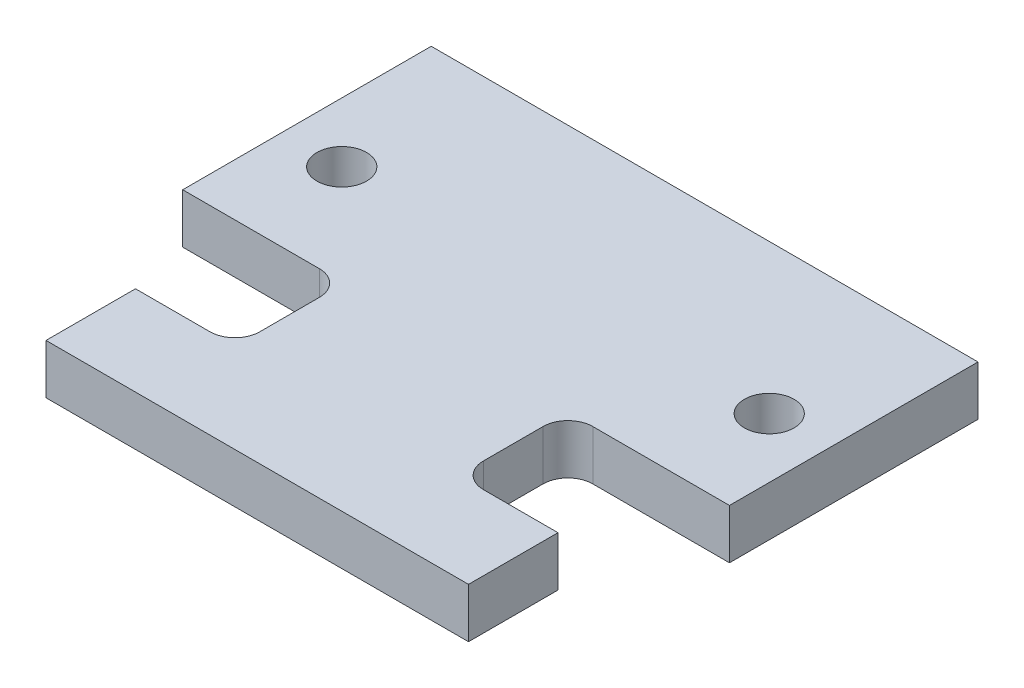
ISO-10303-21;
HEADER;
FILE_DESCRIPTION(('STEP AP214'),'2;1');
FILE_NAME('part.step','',(''),(''),'','','');
FILE_SCHEMA(('AUTOMOTIVE_DESIGN { 1 0 10303 214 1 1 1 1 }'));
ENDSEC;
DATA;
#1=APPLICATION_CONTEXT('core data for automotive mechanical design processes');
#2=APPLICATION_PROTOCOL_DEFINITION('international standard','automotive_design',2000,#1);
#3=PRODUCT_CONTEXT('',#1,'mechanical');
#4=PRODUCT('Part','Part','',(#3));
#5=PRODUCT_RELATED_PRODUCT_CATEGORY('part','',(#4));
#6=PRODUCT_DEFINITION_FORMATION('','',#4);
#7=PRODUCT_DEFINITION_CONTEXT('part definition',#1,'design');
#8=PRODUCT_DEFINITION('design','',#6,#7);
#9=PRODUCT_DEFINITION_SHAPE('','',#8);
#10=(LENGTH_UNIT() NAMED_UNIT(*) SI_UNIT(.MILLI.,.METRE.));
#11=(NAMED_UNIT(*) PLANE_ANGLE_UNIT() SI_UNIT($,.RADIAN.));
#12=(NAMED_UNIT(*) SI_UNIT($,.STERADIAN.) SOLID_ANGLE_UNIT());
#13=UNCERTAINTY_MEASURE_WITH_UNIT(LENGTH_MEASURE(1.E-05),#10,'distance_accuracy_value','');
#14=(GEOMETRIC_REPRESENTATION_CONTEXT(3) GLOBAL_UNCERTAINTY_ASSIGNED_CONTEXT((#13)) GLOBAL_UNIT_ASSIGNED_CONTEXT((#10,
#11,#12)) REPRESENTATION_CONTEXT('',''));
#15=CARTESIAN_POINT('',(0.,0.,0.));
#16=DIRECTION('',(0.,0.,1.));
#17=DIRECTION('',(1.,0.,0.));
#18=AXIS2_PLACEMENT_3D('',#15,#16,#17);
#19=CARTESIAN_POINT('',(-55.,10.,0.));
#20=DIRECTION('',(1.,0.,0.));
#21=DIRECTION('',(0.,0.,-1.));
#22=AXIS2_PLACEMENT_3D('',#19,#20,#21);
#23=PLANE('',#22);
#24=DIRECTION('',(0.,0.,1.));
#25=VECTOR('',#24,1.);
#26=CARTESIAN_POINT('',(-55.,0.,0.));
#27=LINE('',#26,#25);
#28=CARTESIAN_POINT('',(-55.,0.,0.));
#29=VERTEX_POINT('',#28);
#30=CARTESIAN_POINT('',(-55.,0.,50.));
#31=VERTEX_POINT('',#30);
#32=EDGE_CURVE('E177',#29,#31,#27,.T.);
#33=ORIENTED_EDGE('',*,*,#32,.T.);
#34=DIRECTION('',(0.,-1.,0.));
#35=VECTOR('',#34,1.);
#36=CARTESIAN_POINT('',(-55.,10.,50.));
#37=LINE('',#36,#35);
#38=CARTESIAN_POINT('',(-55.,10.,50.));
#39=VERTEX_POINT('',#38);
#40=EDGE_CURVE('E160',#39,#31,#37,.T.);
#41=ORIENTED_EDGE('',*,*,#40,.F.);
#42=DIRECTION('',(0.,0.,1.));
#43=VECTOR('',#42,1.);
#44=CARTESIAN_POINT('',(-55.,10.,0.));
#45=LINE('',#44,#43);
#46=CARTESIAN_POINT('',(-55.,10.,0.));
#47=VERTEX_POINT('',#46);
#48=EDGE_CURVE('E165',#47,#39,#45,.T.);
#49=ORIENTED_EDGE('',*,*,#48,.F.);
#50=DIRECTION('',(0.,-1.,0.));
#51=VECTOR('',#50,1.);
#52=CARTESIAN_POINT('',(-55.,10.,0.));
#53=LINE('',#52,#51);
#54=EDGE_CURVE('E262',#47,#29,#53,.T.);
#55=ORIENTED_EDGE('',*,*,#54,.T.);
#56=EDGE_LOOP('',(#33,#41,#49,#55));
#57=FACE_BOUND('',#56,.T.);
#58=ADVANCED_FACE('F47',(#57),#23,.F.);
#59=CARTESIAN_POINT('',(-55.,10.,50.));
#60=DIRECTION('',(0.,0.,-1.));
#61=DIRECTION('',(-1.,0.,0.));
#62=AXIS2_PLACEMENT_3D('',#59,#60,#61);
#63=PLANE('',#62);
#64=DIRECTION('',(1.,0.,0.));
#65=VECTOR('',#64,1.);
#66=CARTESIAN_POINT('',(-55.,0.,50.));
#67=LINE('',#66,#65);
#68=CARTESIAN_POINT('',(-27.5,0.,50.));
#69=VERTEX_POINT('',#68);
#70=EDGE_CURVE('E239',#31,#69,#67,.T.);
#71=ORIENTED_EDGE('',*,*,#70,.T.);
#72=DIRECTION('',(0.,-1.,0.));
#73=VECTOR('',#72,1.);
#74=CARTESIAN_POINT('',(-27.5,10.,50.));
#75=LINE('',#74,#73);
#76=CARTESIAN_POINT('',(-27.5,10.,50.));
#77=VERTEX_POINT('',#76);
#78=EDGE_CURVE('E62',#69,#77,#75,.F.);
#79=ORIENTED_EDGE('',*,*,#78,.T.);
#80=DIRECTION('',(1.,0.,0.));
#81=VECTOR('',#80,1.);
#82=CARTESIAN_POINT('',(-55.,10.,50.));
#83=LINE('',#82,#81);
#84=EDGE_CURVE('E156',#39,#77,#83,.T.);
#85=ORIENTED_EDGE('',*,*,#84,.F.);
#86=ORIENTED_EDGE('',*,*,#40,.T.);
#87=EDGE_LOOP('',(#71,#79,#85,#86));
#88=FACE_BOUND('',#87,.T.);
#89=ADVANCED_FACE('F158',(#88),#63,.F.);
#90=CARTESIAN_POINT('',(-22.5,10.,50.));
#91=DIRECTION('',(1.,0.,0.));
#92=DIRECTION('',(0.,0.,-1.));
#93=AXIS2_PLACEMENT_3D('',#90,#91,#92);
#94=PLANE('',#93);
#95=DIRECTION('',(0.,0.,1.));
#96=VECTOR('',#95,1.);
#97=CARTESIAN_POINT('',(-22.5,0.,50.));
#98=LINE('',#97,#96);
#99=CARTESIAN_POINT('',(-22.5,0.,55.));
#100=VERTEX_POINT('',#99);
#101=CARTESIAN_POINT('',(-22.5,0.,67.));
#102=VERTEX_POINT('',#101);
#103=EDGE_CURVE('E233',#100,#102,#98,.T.);
#104=ORIENTED_EDGE('',*,*,#103,.T.);
#105=DIRECTION('',(0.,-1.,0.));
#106=VECTOR('',#105,1.);
#107=CARTESIAN_POINT('',(-22.5,10.,67.));
#108=LINE('',#107,#106);
#109=CARTESIAN_POINT('',(-22.5,10.,67.));
#110=VERTEX_POINT('',#109);
#111=EDGE_CURVE('E201',#102,#110,#108,.F.);
#112=ORIENTED_EDGE('',*,*,#111,.T.);
#113=DIRECTION('',(0.,0.,1.));
#114=VECTOR('',#113,1.);
#115=CARTESIAN_POINT('',(-22.5,10.,50.));
#116=LINE('',#115,#114);
#117=CARTESIAN_POINT('',(-22.5,10.,55.));
#118=VERTEX_POINT('',#117);
#119=EDGE_CURVE('E164',#118,#110,#116,.T.);
#120=ORIENTED_EDGE('',*,*,#119,.F.);
#121=DIRECTION('',(0.,-1.,0.));
#122=VECTOR('',#121,1.);
#123=CARTESIAN_POINT('',(-22.5,0.,55.));
#124=LINE('',#123,#122);
#125=EDGE_CURVE('E198',#118,#100,#124,.T.);
#126=ORIENTED_EDGE('',*,*,#125,.T.);
#127=EDGE_LOOP('',(#104,#112,#120,#126));
#128=FACE_BOUND('',#127,.T.);
#129=ADVANCED_FACE('F237',(#128),#94,.F.);
#130=CARTESIAN_POINT('',(-42.5,10.,72.));
#131=DIRECTION('',(0.,0.,1.));
#132=DIRECTION('',(1.,0.,0.));
#133=AXIS2_PLACEMENT_3D('',#130,#131,#132);
#134=PLANE('',#133);
#135=DIRECTION('',(-1.,0.,0.));
#136=VECTOR('',#135,1.);
#137=CARTESIAN_POINT('',(-42.5,10.,72.));
#138=LINE('',#137,#136);
#139=CARTESIAN_POINT('',(-27.5,10.,72.));
#140=VERTEX_POINT('',#139);
#141=CARTESIAN_POINT('',(-42.5,10.,72.));
#142=VERTEX_POINT('',#141);
#143=EDGE_CURVE('E218',#140,#142,#138,.T.);
#144=ORIENTED_EDGE('',*,*,#143,.F.);
#145=DIRECTION('',(0.,-1.,0.));
#146=VECTOR('',#145,1.);
#147=CARTESIAN_POINT('',(-27.5,0.,72.));
#148=LINE('',#147,#146);
#149=CARTESIAN_POINT('',(-27.5,0.,72.));
#150=VERTEX_POINT('',#149);
#151=EDGE_CURVE('E195',#140,#150,#148,.T.);
#152=ORIENTED_EDGE('',*,*,#151,.T.);
#153=DIRECTION('',(-1.,0.,0.));
#154=VECTOR('',#153,1.);
#155=CARTESIAN_POINT('',(-42.5,0.,72.));
#156=LINE('',#155,#154);
#157=CARTESIAN_POINT('',(-42.5,0.,72.));
#158=VERTEX_POINT('',#157);
#159=EDGE_CURVE('E235',#150,#158,#156,.T.);
#160=ORIENTED_EDGE('',*,*,#159,.T.);
#161=DIRECTION('',(0.,-1.,0.));
#162=VECTOR('',#161,1.);
#163=CARTESIAN_POINT('',(-42.5,10.,72.));
#164=LINE('',#163,#162);
#165=EDGE_CURVE('E179',#142,#158,#164,.T.);
#166=ORIENTED_EDGE('',*,*,#165,.F.);
#167=EDGE_LOOP('',(#144,#152,#160,#166));
#168=FACE_BOUND('',#167,.T.);
#169=ADVANCED_FACE('F225',(#168),#134,.F.);
#170=CARTESIAN_POINT('',(-42.5,10.,72.));
#171=DIRECTION('',(1.,0.,0.));
#172=DIRECTION('',(0.,0.,-1.));
#173=AXIS2_PLACEMENT_3D('',#170,#171,#172);
#174=PLANE('',#173);
#175=DIRECTION('',(0.,0.,1.));
#176=VECTOR('',#175,1.);
#177=CARTESIAN_POINT('',(-42.5,0.,72.));
#178=LINE('',#177,#176);
#179=CARTESIAN_POINT('',(-42.5,0.,90.));
#180=VERTEX_POINT('',#179);
#181=EDGE_CURVE('E241',#158,#180,#178,.T.);
#182=ORIENTED_EDGE('',*,*,#181,.T.);
#183=DIRECTION('',(0.,-1.,0.));
#184=VECTOR('',#183,1.);
#185=CARTESIAN_POINT('',(-42.5,10.,90.));
#186=LINE('',#185,#184);
#187=CARTESIAN_POINT('',(-42.5,10.,90.));
#188=VERTEX_POINT('',#187);
#189=EDGE_CURVE('E185',#188,#180,#186,.T.);
#190=ORIENTED_EDGE('',*,*,#189,.F.);
#191=DIRECTION('',(0.,0.,1.));
#192=VECTOR('',#191,1.);
#193=CARTESIAN_POINT('',(-42.5,10.,72.));
#194=LINE('',#193,#192);
#195=EDGE_CURVE('E228',#142,#188,#194,.T.);
#196=ORIENTED_EDGE('',*,*,#195,.F.);
#197=ORIENTED_EDGE('',*,*,#165,.T.);
#198=EDGE_LOOP('',(#182,#190,#196,#197));
#199=FACE_BOUND('',#198,.T.);
#200=ADVANCED_FACE('F323',(#199),#174,.F.);
#201=CARTESIAN_POINT('',(-42.5,10.,90.));
#202=DIRECTION('',(0.,0.,-1.));
#203=DIRECTION('',(-1.,0.,0.));
#204=AXIS2_PLACEMENT_3D('',#201,#202,#203);
#205=PLANE('',#204);
#206=DIRECTION('',(1.,0.,0.));
#207=VECTOR('',#206,1.);
#208=CARTESIAN_POINT('',(-42.5,0.,90.));
#209=LINE('',#208,#207);
#210=CARTESIAN_POINT('',(42.5,0.,90.));
#211=VERTEX_POINT('',#210);
#212=EDGE_CURVE('E247',#180,#211,#209,.T.);
#213=ORIENTED_EDGE('',*,*,#212,.T.);
#214=DIRECTION('',(0.,-1.,0.));
#215=VECTOR('',#214,1.);
#216=CARTESIAN_POINT('',(42.5,10.,90.));
#217=LINE('',#216,#215);
#218=CARTESIAN_POINT('',(42.5,10.,90.));
#219=VERTEX_POINT('',#218);
#220=EDGE_CURVE('E273',#219,#211,#217,.T.);
#221=ORIENTED_EDGE('',*,*,#220,.F.);
#222=DIRECTION('',(1.,0.,0.));
#223=VECTOR('',#222,1.);
#224=CARTESIAN_POINT('',(-42.5,10.,90.));
#225=LINE('',#224,#223);
#226=EDGE_CURVE('E282',#188,#219,#225,.T.);
#227=ORIENTED_EDGE('',*,*,#226,.F.);
#228=ORIENTED_EDGE('',*,*,#189,.T.);
#229=EDGE_LOOP('',(#213,#221,#227,#228));
#230=FACE_BOUND('',#229,.T.);
#231=ADVANCED_FACE('F280',(#230),#205,.F.);
#232=CARTESIAN_POINT('',(42.5,10.,72.));
#233=DIRECTION('',(-1.,0.,0.));
#234=DIRECTION('',(0.,0.,1.));
#235=AXIS2_PLACEMENT_3D('',#232,#233,#234);
#236=PLANE('',#235);
#237=DIRECTION('',(0.,0.,-1.));
#238=VECTOR('',#237,1.);
#239=CARTESIAN_POINT('',(42.5,0.,72.));
#240=LINE('',#239,#238);
#241=CARTESIAN_POINT('',(42.5,0.,72.));
#242=VERTEX_POINT('',#241);
#243=EDGE_CURVE('E249',#211,#242,#240,.T.);
#244=ORIENTED_EDGE('',*,*,#243,.T.);
#245=DIRECTION('',(0.,-1.,0.));
#246=VECTOR('',#245,1.);
#247=CARTESIAN_POINT('',(42.5,10.,72.));
#248=LINE('',#247,#246);
#249=CARTESIAN_POINT('',(42.5,10.,72.));
#250=VERTEX_POINT('',#249);
#251=EDGE_CURVE('E270',#250,#242,#248,.T.);
#252=ORIENTED_EDGE('',*,*,#251,.F.);
#253=DIRECTION('',(0.,0.,-1.));
#254=VECTOR('',#253,1.);
#255=CARTESIAN_POINT('',(42.5,10.,72.));
#256=LINE('',#255,#254);
#257=EDGE_CURVE('E298',#219,#250,#256,.T.);
#258=ORIENTED_EDGE('',*,*,#257,.F.);
#259=ORIENTED_EDGE('',*,*,#220,.T.);
#260=EDGE_LOOP('',(#244,#252,#258,#259));
#261=FACE_BOUND('',#260,.T.);
#262=ADVANCED_FACE('F288',(#261),#236,.F.);
#263=CARTESIAN_POINT('',(22.5,10.,72.));
#264=DIRECTION('',(0.,0.,1.));
#265=DIRECTION('',(1.,0.,0.));
#266=AXIS2_PLACEMENT_3D('',#263,#264,#265);
#267=PLANE('',#266);
#268=DIRECTION('',(-1.,0.,0.));
#269=VECTOR('',#268,1.);
#270=CARTESIAN_POINT('',(22.5,0.,72.));
#271=LINE('',#270,#269);
#272=CARTESIAN_POINT('',(27.5,0.,72.));
#273=VERTEX_POINT('',#272);
#274=EDGE_CURVE('E251',#242,#273,#271,.T.);
#275=ORIENTED_EDGE('',*,*,#274,.T.);
#276=DIRECTION('',(0.,-1.,0.));
#277=VECTOR('',#276,1.);
#278=CARTESIAN_POINT('',(27.5,10.,72.));
#279=LINE('',#278,#277);
#280=CARTESIAN_POINT('',(27.5,10.,72.));
#281=VERTEX_POINT('',#280);
#282=EDGE_CURVE('E193',#273,#281,#279,.F.);
#283=ORIENTED_EDGE('',*,*,#282,.T.);
#284=DIRECTION('',(-1.,0.,0.));
#285=VECTOR('',#284,1.);
#286=CARTESIAN_POINT('',(22.5,10.,72.));
#287=LINE('',#286,#285);
#288=EDGE_CURVE('E295',#250,#281,#287,.T.);
#289=ORIENTED_EDGE('',*,*,#288,.F.);
#290=ORIENTED_EDGE('',*,*,#251,.T.);
#291=EDGE_LOOP('',(#275,#283,#289,#290));
#292=FACE_BOUND('',#291,.T.);
#293=ADVANCED_FACE('F292',(#292),#267,.F.);
#294=CARTESIAN_POINT('',(22.5,10.,50.));
#295=DIRECTION('',(-1.,0.,0.));
#296=DIRECTION('',(0.,0.,1.));
#297=AXIS2_PLACEMENT_3D('',#294,#295,#296);
#298=PLANE('',#297);
#299=DIRECTION('',(0.,0.,-1.));
#300=VECTOR('',#299,1.);
#301=CARTESIAN_POINT('',(22.5,0.,50.));
#302=LINE('',#301,#300);
#303=CARTESIAN_POINT('',(22.5,0.,67.));
#304=VERTEX_POINT('',#303);
#305=CARTESIAN_POINT('',(22.5,0.,55.));
#306=VERTEX_POINT('',#305);
#307=EDGE_CURVE('E254',#304,#306,#302,.T.);
#308=ORIENTED_EDGE('',*,*,#307,.T.);
#309=DIRECTION('',(0.,-1.,0.));
#310=VECTOR('',#309,1.);
#311=CARTESIAN_POINT('',(22.5,10.,55.));
#312=LINE('',#311,#310);
#313=CARTESIAN_POINT('',(22.5,10.,55.));
#314=VERTEX_POINT('',#313);
#315=EDGE_CURVE('E191',#306,#314,#312,.F.);
#316=ORIENTED_EDGE('',*,*,#315,.T.);
#317=DIRECTION('',(0.,0.,-1.));
#318=VECTOR('',#317,1.);
#319=CARTESIAN_POINT('',(22.5,10.,50.));
#320=LINE('',#319,#318);
#321=CARTESIAN_POINT('',(22.5,10.,67.));
#322=VERTEX_POINT('',#321);
#323=EDGE_CURVE('E297',#322,#314,#320,.T.);
#324=ORIENTED_EDGE('',*,*,#323,.F.);
#325=DIRECTION('',(0.,-1.,0.));
#326=VECTOR('',#325,1.);
#327=CARTESIAN_POINT('',(22.5,0.,67.));
#328=LINE('',#327,#326);
#329=EDGE_CURVE('E182',#322,#304,#328,.T.);
#330=ORIENTED_EDGE('',*,*,#329,.T.);
#331=EDGE_LOOP('',(#308,#316,#324,#330));
#332=FACE_BOUND('',#331,.T.);
#333=ADVANCED_FACE('F408',(#332),#298,.F.);
#334=CARTESIAN_POINT('',(22.5,10.,50.));
#335=DIRECTION('',(0.,0.,-1.));
#336=DIRECTION('',(-1.,0.,0.));
#337=AXIS2_PLACEMENT_3D('',#334,#335,#336);
#338=PLANE('',#337);
#339=DIRECTION('',(1.,0.,0.));
#340=VECTOR('',#339,1.);
#341=CARTESIAN_POINT('',(22.5,10.,50.));
#342=LINE('',#341,#340);
#343=CARTESIAN_POINT('',(27.5,10.,50.));
#344=VERTEX_POINT('',#343);
#345=CARTESIAN_POINT('',(55.,10.,50.));
#346=VERTEX_POINT('',#345);
#347=EDGE_CURVE('E301',#344,#346,#342,.T.);
#348=ORIENTED_EDGE('',*,*,#347,.F.);
#349=DIRECTION('',(0.,-1.,0.));
#350=VECTOR('',#349,1.);
#351=CARTESIAN_POINT('',(27.5,0.,50.));
#352=LINE('',#351,#350);
#353=CARTESIAN_POINT('',(27.5,0.,50.));
#354=VERTEX_POINT('',#353);
#355=EDGE_CURVE('E178',#344,#354,#352,.T.);
#356=ORIENTED_EDGE('',*,*,#355,.T.);
#357=DIRECTION('',(1.,0.,0.));
#358=VECTOR('',#357,1.);
#359=CARTESIAN_POINT('',(22.5,0.,50.));
#360=LINE('',#359,#358);
#361=CARTESIAN_POINT('',(55.,0.,50.));
#362=VERTEX_POINT('',#361);
#363=EDGE_CURVE('E257',#354,#362,#360,.T.);
#364=ORIENTED_EDGE('',*,*,#363,.T.);
#365=DIRECTION('',(0.,-1.,0.));
#366=VECTOR('',#365,1.);
#367=CARTESIAN_POINT('',(55.,10.,50.));
#368=LINE('',#367,#366);
#369=EDGE_CURVE('E267',#346,#362,#368,.T.);
#370=ORIENTED_EDGE('',*,*,#369,.F.);
#371=EDGE_LOOP('',(#348,#356,#364,#370));
#372=FACE_BOUND('',#371,.T.);
#373=ADVANCED_FACE('F402',(#372),#338,.F.);
#374=CARTESIAN_POINT('',(55.,10.,0.));
#375=DIRECTION('',(-1.,0.,0.));
#376=DIRECTION('',(0.,0.,1.));
#377=AXIS2_PLACEMENT_3D('',#374,#375,#376);
#378=PLANE('',#377);
#379=DIRECTION('',(0.,0.,-1.));
#380=VECTOR('',#379,1.);
#381=CARTESIAN_POINT('',(55.,0.,0.));
#382=LINE('',#381,#380);
#383=CARTESIAN_POINT('',(55.,0.,0.));
#384=VERTEX_POINT('',#383);
#385=EDGE_CURVE('E259',#362,#384,#382,.T.);
#386=ORIENTED_EDGE('',*,*,#385,.T.);
#387=DIRECTION('',(0.,-1.,0.));
#388=VECTOR('',#387,1.);
#389=CARTESIAN_POINT('',(55.,10.,0.));
#390=LINE('',#389,#388);
#391=CARTESIAN_POINT('',(55.,10.,0.));
#392=VERTEX_POINT('',#391);
#393=EDGE_CURVE('E264',#392,#384,#390,.T.);
#394=ORIENTED_EDGE('',*,*,#393,.F.);
#395=DIRECTION('',(0.,0.,-1.));
#396=VECTOR('',#395,1.);
#397=CARTESIAN_POINT('',(55.,10.,0.));
#398=LINE('',#397,#396);
#399=EDGE_CURVE('E307',#346,#392,#398,.T.);
#400=ORIENTED_EDGE('',*,*,#399,.F.);
#401=ORIENTED_EDGE('',*,*,#369,.T.);
#402=EDGE_LOOP('',(#386,#394,#400,#401));
#403=FACE_BOUND('',#402,.T.);
#404=ADVANCED_FACE('F407',(#403),#378,.F.);
#405=CARTESIAN_POINT('',(-55.,10.,0.));
#406=DIRECTION('',(0.,0.,1.));
#407=DIRECTION('',(1.,0.,0.));
#408=AXIS2_PLACEMENT_3D('',#405,#406,#407);
#409=PLANE('',#408);
#410=DIRECTION('',(-1.,0.,0.));
#411=VECTOR('',#410,1.);
#412=CARTESIAN_POINT('',(-55.,0.,0.));
#413=LINE('',#412,#411);
#414=EDGE_CURVE('E174',#384,#29,#413,.T.);
#415=ORIENTED_EDGE('',*,*,#414,.T.);
#416=ORIENTED_EDGE('',*,*,#54,.F.);
#417=DIRECTION('',(-1.,0.,0.));
#418=VECTOR('',#417,1.);
#419=CARTESIAN_POINT('',(-55.,10.,0.));
#420=LINE('',#419,#418);
#421=EDGE_CURVE('E170',#392,#47,#420,.T.);
#422=ORIENTED_EDGE('',*,*,#421,.F.);
#423=ORIENTED_EDGE('',*,*,#393,.T.);
#424=EDGE_LOOP('',(#415,#416,#422,#423));
#425=FACE_BOUND('',#424,.T.);
#426=ADVANCED_FACE('F394',(#425),#409,.F.);
#427=CARTESIAN_POINT('',(0.,10.,0.));
#428=DIRECTION('',(0.,1.,0.));
#429=DIRECTION('',(0.,0.,1.));
#430=AXIS2_PLACEMENT_3D('',#427,#428,#429);
#431=PLANE('',#430);
#432=CARTESIAN_POINT('',(-43.,10.,30.));
#433=DIRECTION('',(0.,-1.,0.));
#434=DIRECTION('',(0.,0.,1.));
#435=AXIS2_PLACEMENT_3D('',#432,#433,#434);
#436=CIRCLE('',#435,4.99999999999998);
#437=CARTESIAN_POINT('',(-43.,10.,35.));
#438=VERTEX_POINT('',#437);
#439=EDGE_CURVE('E319',#438,#438,#436,.T.);
#440=ORIENTED_EDGE('',*,*,#439,.T.);
#441=EDGE_LOOP('',(#440));
#442=FACE_BOUND('',#441,.T.);
#443=CARTESIAN_POINT('',(43.,10.,30.));
#444=DIRECTION('',(0.,1.,0.));
#445=DIRECTION('',(0.,0.,1.));
#446=AXIS2_PLACEMENT_3D('',#443,#444,#445);
#447=CIRCLE('',#446,4.99999999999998);
#448=CARTESIAN_POINT('',(43.,10.,35.));
#449=VERTEX_POINT('',#448);
#450=EDGE_CURVE('E311',#449,#449,#447,.T.);
#451=ORIENTED_EDGE('',*,*,#450,.F.);
#452=EDGE_LOOP('',(#451));
#453=FACE_BOUND('',#452,.T.);
#454=ORIENTED_EDGE('',*,*,#48,.T.);
#455=ORIENTED_EDGE('',*,*,#84,.T.);
#456=CARTESIAN_POINT('',(-27.5,10.,55.));
#457=DIRECTION('',(0.,1.,0.));
#458=DIRECTION('',(0.,0.,1.));
#459=AXIS2_PLACEMENT_3D('',#456,#457,#458);
#460=CIRCLE('',#459,5.);
#461=EDGE_CURVE('E13',#77,#118,#460,.F.);
#462=ORIENTED_EDGE('',*,*,#461,.T.);
#463=ORIENTED_EDGE('',*,*,#119,.T.);
#464=CARTESIAN_POINT('',(-27.5,10.,67.));
#465=DIRECTION('',(0.,1.,0.));
#466=DIRECTION('',(0.,0.,1.));
#467=AXIS2_PLACEMENT_3D('',#464,#465,#466);
#468=CIRCLE('',#467,5.);
#469=EDGE_CURVE('E214',#110,#140,#468,.F.);
#470=ORIENTED_EDGE('',*,*,#469,.T.);
#471=ORIENTED_EDGE('',*,*,#143,.T.);
#472=ORIENTED_EDGE('',*,*,#195,.T.);
#473=ORIENTED_EDGE('',*,*,#226,.T.);
#474=ORIENTED_EDGE('',*,*,#257,.T.);
#475=ORIENTED_EDGE('',*,*,#288,.T.);
#476=CARTESIAN_POINT('',(27.5,10.,67.));
#477=DIRECTION('',(0.,1.,0.));
#478=DIRECTION('',(0.,0.,1.));
#479=AXIS2_PLACEMENT_3D('',#476,#477,#478);
#480=CIRCLE('',#479,5.);
#481=EDGE_CURVE('E210',#281,#322,#480,.F.);
#482=ORIENTED_EDGE('',*,*,#481,.T.);
#483=ORIENTED_EDGE('',*,*,#323,.T.);
#484=CARTESIAN_POINT('',(27.5,10.,55.));
#485=DIRECTION('',(0.,1.,0.));
#486=DIRECTION('',(0.,0.,1.));
#487=AXIS2_PLACEMENT_3D('',#484,#485,#486);
#488=CIRCLE('',#487,5.);
#489=EDGE_CURVE('E206',#314,#344,#488,.F.);
#490=ORIENTED_EDGE('',*,*,#489,.T.);
#491=ORIENTED_EDGE('',*,*,#347,.T.);
#492=ORIENTED_EDGE('',*,*,#399,.T.);
#493=ORIENTED_EDGE('',*,*,#421,.T.);
#494=EDGE_LOOP('',(#454,#455,#462,#463,#470,#471,#472,#473,#474,#475,#482,#483,#490,#491,#492,#493));
#495=FACE_BOUND('',#494,.T.);
#496=ADVANCED_FACE('F168',(#442,#453,#495),#431,.T.);
#497=CARTESIAN_POINT('',(0.,0.,0.));
#498=DIRECTION('',(0.,1.,0.));
#499=DIRECTION('',(0.,0.,1.));
#500=AXIS2_PLACEMENT_3D('',#497,#498,#499);
#501=PLANE('',#500);
#502=CARTESIAN_POINT('',(-43.,0.,30.));
#503=DIRECTION('',(0.,-1.,0.));
#504=DIRECTION('',(0.,0.,1.));
#505=AXIS2_PLACEMENT_3D('',#502,#503,#504);
#506=CIRCLE('',#505,4.99999999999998);
#507=CARTESIAN_POINT('',(-43.,0.,35.));
#508=VERTEX_POINT('',#507);
#509=EDGE_CURVE('E316',#508,#508,#506,.T.);
#510=ORIENTED_EDGE('',*,*,#509,.F.);
#511=EDGE_LOOP('',(#510));
#512=FACE_BOUND('',#511,.T.);
#513=CARTESIAN_POINT('',(43.,0.,30.));
#514=DIRECTION('',(0.,1.,0.));
#515=DIRECTION('',(0.,0.,1.));
#516=AXIS2_PLACEMENT_3D('',#513,#514,#515);
#517=CIRCLE('',#516,4.99999999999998);
#518=CARTESIAN_POINT('',(43.,0.,35.));
#519=VERTEX_POINT('',#518);
#520=EDGE_CURVE('E309',#519,#519,#517,.T.);
#521=ORIENTED_EDGE('',*,*,#520,.T.);
#522=EDGE_LOOP('',(#521));
#523=FACE_BOUND('',#522,.T.);
#524=ORIENTED_EDGE('',*,*,#32,.F.);
#525=ORIENTED_EDGE('',*,*,#414,.F.);
#526=ORIENTED_EDGE('',*,*,#385,.F.);
#527=ORIENTED_EDGE('',*,*,#363,.F.);
#528=CARTESIAN_POINT('',(27.5,0.,55.));
#529=DIRECTION('',(0.,1.,0.));
#530=DIRECTION('',(0.,0.,1.));
#531=AXIS2_PLACEMENT_3D('',#528,#529,#530);
#532=CIRCLE('',#531,5.);
#533=EDGE_CURVE('E204',#354,#306,#532,.T.);
#534=ORIENTED_EDGE('',*,*,#533,.T.);
#535=ORIENTED_EDGE('',*,*,#307,.F.);
#536=CARTESIAN_POINT('',(27.5,0.,67.));
#537=DIRECTION('',(0.,1.,0.));
#538=DIRECTION('',(0.,0.,1.));
#539=AXIS2_PLACEMENT_3D('',#536,#537,#538);
#540=CIRCLE('',#539,5.);
#541=EDGE_CURVE('E208',#304,#273,#540,.T.);
#542=ORIENTED_EDGE('',*,*,#541,.T.);
#543=ORIENTED_EDGE('',*,*,#274,.F.);
#544=ORIENTED_EDGE('',*,*,#243,.F.);
#545=ORIENTED_EDGE('',*,*,#212,.F.);
#546=ORIENTED_EDGE('',*,*,#181,.F.);
#547=ORIENTED_EDGE('',*,*,#159,.F.);
#548=CARTESIAN_POINT('',(-27.5,0.,67.));
#549=DIRECTION('',(0.,1.,0.));
#550=DIRECTION('',(0.,0.,1.));
#551=AXIS2_PLACEMENT_3D('',#548,#549,#550);
#552=CIRCLE('',#551,5.);
#553=EDGE_CURVE('E212',#150,#102,#552,.T.);
#554=ORIENTED_EDGE('',*,*,#553,.T.);
#555=ORIENTED_EDGE('',*,*,#103,.F.);
#556=CARTESIAN_POINT('',(-27.5,0.,55.));
#557=DIRECTION('',(0.,1.,0.));
#558=DIRECTION('',(0.,0.,1.));
#559=AXIS2_PLACEMENT_3D('',#556,#557,#558);
#560=CIRCLE('',#559,5.);
#561=EDGE_CURVE('E55',#100,#69,#560,.T.);
#562=ORIENTED_EDGE('',*,*,#561,.T.);
#563=ORIENTED_EDGE('',*,*,#70,.F.);
#564=EDGE_LOOP('',(#524,#525,#526,#527,#534,#535,#542,#543,#544,#545,#546,#547,#554,#555,#562,#563));
#565=FACE_BOUND('',#564,.T.);
#566=ADVANCED_FACE('F232',(#512,#523,#565),#501,.F.);
#567=CARTESIAN_POINT('',(43.,0.,30.));
#568=DIRECTION('',(0.,1.,0.));
#569=DIRECTION('',(0.,0.,1.));
#570=AXIS2_PLACEMENT_3D('',#567,#568,#569);
#571=CYLINDRICAL_SURFACE('',#570,4.99999999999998);
#572=ORIENTED_EDGE('',*,*,#520,.F.);
#573=EDGE_LOOP('',(#572));
#574=FACE_BOUND('',#573,.T.);
#575=ORIENTED_EDGE('',*,*,#450,.T.);
#576=EDGE_LOOP('',(#575));
#577=FACE_BOUND('',#576,.T.);
#578=ADVANCED_FACE('F382',(#574,#577),#571,.F.);
#579=CARTESIAN_POINT('',(-43.,0.,30.));
#580=DIRECTION('',(0.,1.,0.));
#581=DIRECTION('',(0.,0.,1.));
#582=AXIS2_PLACEMENT_3D('',#579,#580,#581);
#583=CYLINDRICAL_SURFACE('',#582,4.99999999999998);
#584=ORIENTED_EDGE('',*,*,#509,.T.);
#585=EDGE_LOOP('',(#584));
#586=FACE_BOUND('',#585,.T.);
#587=ORIENTED_EDGE('',*,*,#439,.F.);
#588=EDGE_LOOP('',(#587));
#589=FACE_BOUND('',#588,.T.);
#590=ADVANCED_FACE('F344',(#586,#589),#583,.F.);
#591=CARTESIAN_POINT('',(27.5,10.,55.));
#592=DIRECTION('',(0.,1.,0.));
#593=DIRECTION('',(0.,0.,1.));
#594=AXIS2_PLACEMENT_3D('',#591,#592,#593);
#595=CYLINDRICAL_SURFACE('',#594,5.);
#596=ORIENTED_EDGE('',*,*,#489,.F.);
#597=ORIENTED_EDGE('',*,*,#315,.F.);
#598=ORIENTED_EDGE('',*,*,#533,.F.);
#599=ORIENTED_EDGE('',*,*,#355,.F.);
#600=EDGE_LOOP('',(#596,#597,#598,#599));
#601=FACE_BOUND('',#600,.T.);
#602=ADVANCED_FACE('F340',(#601),#595,.F.);
#603=CARTESIAN_POINT('',(27.5,10.,67.));
#604=DIRECTION('',(0.,1.,0.));
#605=DIRECTION('',(0.,0.,1.));
#606=AXIS2_PLACEMENT_3D('',#603,#604,#605);
#607=CYLINDRICAL_SURFACE('',#606,5.);
#608=ORIENTED_EDGE('',*,*,#481,.F.);
#609=ORIENTED_EDGE('',*,*,#282,.F.);
#610=ORIENTED_EDGE('',*,*,#541,.F.);
#611=ORIENTED_EDGE('',*,*,#329,.F.);
#612=EDGE_LOOP('',(#608,#609,#610,#611));
#613=FACE_BOUND('',#612,.T.);
#614=ADVANCED_FACE('F343',(#613),#607,.F.);
#615=CARTESIAN_POINT('',(-27.5,10.,67.));
#616=DIRECTION('',(0.,1.,0.));
#617=DIRECTION('',(0.,0.,1.));
#618=AXIS2_PLACEMENT_3D('',#615,#616,#617);
#619=CYLINDRICAL_SURFACE('',#618,5.);
#620=ORIENTED_EDGE('',*,*,#469,.F.);
#621=ORIENTED_EDGE('',*,*,#111,.F.);
#622=ORIENTED_EDGE('',*,*,#553,.F.);
#623=ORIENTED_EDGE('',*,*,#151,.F.);
#624=EDGE_LOOP('',(#620,#621,#622,#623));
#625=FACE_BOUND('',#624,.T.);
#626=ADVANCED_FACE('F230',(#625),#619,.F.);
#627=CARTESIAN_POINT('',(-27.5,10.,55.));
#628=DIRECTION('',(0.,1.,0.));
#629=DIRECTION('',(0.,0.,1.));
#630=AXIS2_PLACEMENT_3D('',#627,#628,#629);
#631=CYLINDRICAL_SURFACE('',#630,5.);
#632=ORIENTED_EDGE('',*,*,#461,.F.);
#633=ORIENTED_EDGE('',*,*,#78,.F.);
#634=ORIENTED_EDGE('',*,*,#561,.F.);
#635=ORIENTED_EDGE('',*,*,#125,.F.);
#636=EDGE_LOOP('',(#632,#633,#634,#635));
#637=FACE_BOUND('',#636,.T.);
#638=ADVANCED_FACE('F49',(#637),#631,.F.);
#639=CLOSED_SHELL('',(#58,#89,#129,#169,#200,#231,#262,#293,#333,#373,#404,#426,#496,#566,#578,
#590,#602,#614,#626,#638));
#640=MANIFOLD_SOLID_BREP('B2',#639);
#641=ADVANCED_BREP_SHAPE_REPRESENTATION('',(#18,#640),#14);
#642=SHAPE_DEFINITION_REPRESENTATION(#9,#641);
ENDSEC;
END-ISO-10303-21;
